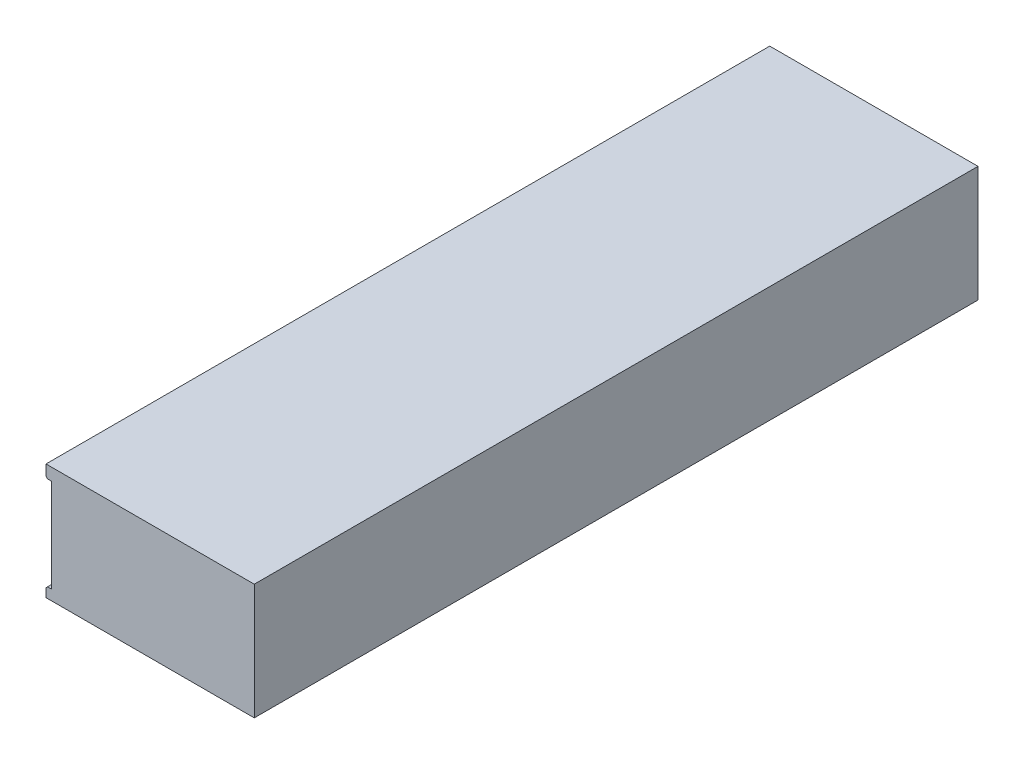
ISO-10303-21;
HEADER;
FILE_DESCRIPTION(('STEP AP214'),'2;1');
FILE_NAME('part.step','',(''),(''),'','','');
FILE_SCHEMA(('AUTOMOTIVE_DESIGN { 1 0 10303 214 1 1 1 1 }'));
ENDSEC;
DATA;
#1=APPLICATION_CONTEXT('core data for automotive mechanical design processes');
#2=APPLICATION_PROTOCOL_DEFINITION('international standard','automotive_design',2000,#1);
#3=PRODUCT_CONTEXT('',#1,'mechanical');
#4=PRODUCT('Part','Part','',(#3));
#5=PRODUCT_RELATED_PRODUCT_CATEGORY('part','',(#4));
#6=PRODUCT_DEFINITION_FORMATION('','',#4);
#7=PRODUCT_DEFINITION_CONTEXT('part definition',#1,'design');
#8=PRODUCT_DEFINITION('design','',#6,#7);
#9=PRODUCT_DEFINITION_SHAPE('','',#8);
#10=(LENGTH_UNIT() NAMED_UNIT(*) SI_UNIT(.MILLI.,.METRE.));
#11=(NAMED_UNIT(*) PLANE_ANGLE_UNIT() SI_UNIT($,.RADIAN.));
#12=(NAMED_UNIT(*) SI_UNIT($,.STERADIAN.) SOLID_ANGLE_UNIT());
#13=UNCERTAINTY_MEASURE_WITH_UNIT(LENGTH_MEASURE(1.E-05),#10,'distance_accuracy_value','');
#14=(GEOMETRIC_REPRESENTATION_CONTEXT(3) GLOBAL_UNCERTAINTY_ASSIGNED_CONTEXT((#13)) GLOBAL_UNIT_ASSIGNED_CONTEXT((#10,
#11,#12)) REPRESENTATION_CONTEXT('',''));
#15=CARTESIAN_POINT('',(0.,0.,0.));
#16=DIRECTION('',(0.,0.,1.));
#17=DIRECTION('',(1.,0.,0.));
#18=AXIS2_PLACEMENT_3D('',#15,#16,#17);
#19=CARTESIAN_POINT('',(-1.39699999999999,0.,90.4748));
#20=DIRECTION('',(0.,-1.,0.));
#21=DIRECTION('',(0.,0.,-1.));
#22=AXIS2_PLACEMENT_3D('',#19,#20,#21);
#23=PLANE('',#22);
#24=DIRECTION('',(-1.,0.,0.));
#25=VECTOR('',#24,1.);
#26=CARTESIAN_POINT('',(-1.39699999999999,0.,-90.4748));
#27=LINE('',#26,#25);
#28=CARTESIAN_POINT('',(50.673,0.,-90.4748));
#29=VERTEX_POINT('',#28);
#30=CARTESIAN_POINT('',(-1.39699999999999,0.,-90.4748));
#31=VERTEX_POINT('',#30);
#32=EDGE_CURVE('E240',#29,#31,#27,.T.);
#33=ORIENTED_EDGE('',*,*,#32,.T.);
#34=DIRECTION('',(0.,0.,-1.));
#35=VECTOR('',#34,1.);
#36=CARTESIAN_POINT('',(-1.39699999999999,0.,90.4748));
#37=LINE('',#36,#35);
#38=CARTESIAN_POINT('',(-1.39699999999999,0.,90.4748));
#39=VERTEX_POINT('',#38);
#40=EDGE_CURVE('E291',#39,#31,#37,.T.);
#41=ORIENTED_EDGE('',*,*,#40,.F.);
#42=DIRECTION('',(-1.,0.,0.));
#43=VECTOR('',#42,1.);
#44=CARTESIAN_POINT('',(-1.39699999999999,0.,90.4748));
#45=LINE('',#44,#43);
#46=CARTESIAN_POINT('',(50.673,0.,90.4748));
#47=VERTEX_POINT('',#46);
#48=EDGE_CURVE('E241',#47,#39,#45,.T.);
#49=ORIENTED_EDGE('',*,*,#48,.F.);
#50=DIRECTION('',(0.,0.,-1.));
#51=VECTOR('',#50,1.);
#52=CARTESIAN_POINT('',(50.673,0.,90.4748));
#53=LINE('',#52,#51);
#54=EDGE_CURVE('E260',#47,#29,#53,.T.);
#55=ORIENTED_EDGE('',*,*,#54,.T.);
#56=EDGE_LOOP('',(#33,#41,#49,#55));
#57=FACE_BOUND('',#56,.T.);
#58=ADVANCED_FACE('F37',(#57),#23,.F.);
#59=CARTESIAN_POINT('',(-1.39699999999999,-3.048,90.4748));
#60=DIRECTION('',(1.,0.,0.));
#61=DIRECTION('',(0.,0.,-1.));
#62=AXIS2_PLACEMENT_3D('',#59,#60,#61);
#63=PLANE('',#62);
#64=DIRECTION('',(0.,-1.,0.));
#65=VECTOR('',#64,1.);
#66=CARTESIAN_POINT('',(-1.39699999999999,-3.048,-90.4748));
#67=LINE('',#66,#65);
#68=CARTESIAN_POINT('',(-1.39699999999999,-2.66700000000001,-90.4748));
#69=VERTEX_POINT('',#68);
#70=EDGE_CURVE('E263',#31,#69,#67,.T.);
#71=ORIENTED_EDGE('',*,*,#70,.T.);
#72=DIRECTION('',(0.,0.,1.));
#73=VECTOR('',#72,1.);
#74=CARTESIAN_POINT('',(-1.39699999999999,-2.66700000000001,90.4748));
#75=LINE('',#74,#73);
#76=CARTESIAN_POINT('',(-1.39699999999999,-2.66700000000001,90.4748));
#77=VERTEX_POINT('',#76);
#78=EDGE_CURVE('E11',#69,#77,#75,.T.);
#79=ORIENTED_EDGE('',*,*,#78,.T.);
#80=DIRECTION('',(0.,-1.,0.));
#81=VECTOR('',#80,1.);
#82=CARTESIAN_POINT('',(-1.39699999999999,-3.048,90.4748));
#83=LINE('',#82,#81);
#84=EDGE_CURVE('E244',#39,#77,#83,.T.);
#85=ORIENTED_EDGE('',*,*,#84,.F.);
#86=ORIENTED_EDGE('',*,*,#40,.T.);
#87=EDGE_LOOP('',(#71,#79,#85,#86));
#88=FACE_BOUND('',#87,.T.);
#89=ADVANCED_FACE('F347',(#88),#63,.F.);
#90=CARTESIAN_POINT('',(0.,-3.048,90.4748));
#91=DIRECTION('',(0.,1.,0.));
#92=DIRECTION('',(0.,0.,1.));
#93=AXIS2_PLACEMENT_3D('',#90,#91,#92);
#94=PLANE('',#93);
#95=DIRECTION('',(1.,0.,0.));
#96=VECTOR('',#95,1.);
#97=CARTESIAN_POINT('',(0.,-3.048,90.4748));
#98=LINE('',#97,#96);
#99=CARTESIAN_POINT('',(-1.016,-3.048,90.4748));
#100=VERTEX_POINT('',#99);
#101=CARTESIAN_POINT('',(0.,-3.048,90.4748));
#102=VERTEX_POINT('',#101);
#103=EDGE_CURVE('E247',#100,#102,#98,.T.);
#104=ORIENTED_EDGE('',*,*,#103,.F.);
#105=DIRECTION('',(0.,0.,-1.));
#106=VECTOR('',#105,1.);
#107=CARTESIAN_POINT('',(-1.016,-3.048,90.4748));
#108=LINE('',#107,#106);
#109=CARTESIAN_POINT('',(-1.016,-3.048,-90.4748));
#110=VERTEX_POINT('',#109);
#111=EDGE_CURVE('E45',#100,#110,#108,.T.);
#112=ORIENTED_EDGE('',*,*,#111,.T.);
#113=DIRECTION('',(1.,0.,0.));
#114=VECTOR('',#113,1.);
#115=CARTESIAN_POINT('',(0.,-3.048,-90.4748));
#116=LINE('',#115,#114);
#117=CARTESIAN_POINT('',(0.,-3.048,-90.4748));
#118=VERTEX_POINT('',#117);
#119=EDGE_CURVE('E265',#110,#118,#116,.T.);
#120=ORIENTED_EDGE('',*,*,#119,.T.);
#121=DIRECTION('',(0.,0.,-1.));
#122=VECTOR('',#121,1.);
#123=CARTESIAN_POINT('',(0.,-3.048,90.4748));
#124=LINE('',#123,#122);
#125=EDGE_CURVE('E288',#102,#118,#124,.T.);
#126=ORIENTED_EDGE('',*,*,#125,.F.);
#127=EDGE_LOOP('',(#104,#112,#120,#126));
#128=FACE_BOUND('',#127,.T.);
#129=ADVANCED_FACE('F309',(#128),#94,.F.);
#130=CARTESIAN_POINT('',(0.,-26.416,90.4748));
#131=DIRECTION('',(1.,0.,0.));
#132=DIRECTION('',(0.,0.,-1.));
#133=AXIS2_PLACEMENT_3D('',#130,#131,#132);
#134=PLANE('',#133);
#135=CARTESIAN_POINT('',(0.,-6.34999999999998,-85.598));
#136=DIRECTION('',(-1.,0.,0.));
#137=DIRECTION('',(0.,0.,1.));
#138=AXIS2_PLACEMENT_3D('',#135,#136,#137);
#139=CIRCLE('',#138,2.413);
#140=CARTESIAN_POINT('',(0.,-6.34999999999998,-83.185));
#141=VERTEX_POINT('',#140);
#142=EDGE_CURVE('E153',#141,#141,#139,.T.);
#143=ORIENTED_EDGE('',*,*,#142,.F.);
#144=EDGE_LOOP('',(#143));
#145=FACE_BOUND('',#144,.T.);
#146=CARTESIAN_POINT('',(0.,-6.34999999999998,85.598));
#147=DIRECTION('',(-1.,0.,0.));
#148=DIRECTION('',(0.,0.,1.));
#149=AXIS2_PLACEMENT_3D('',#146,#147,#148);
#150=CIRCLE('',#149,2.413);
#151=CARTESIAN_POINT('',(0.,-6.34999999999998,88.011));
#152=VERTEX_POINT('',#151);
#153=EDGE_CURVE('E165',#152,#152,#150,.T.);
#154=ORIENTED_EDGE('',*,*,#153,.F.);
#155=EDGE_LOOP('',(#154));
#156=FACE_BOUND('',#155,.T.);
#157=CARTESIAN_POINT('',(0.,-6.34999999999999,4.8768));
#158=DIRECTION('',(-1.,0.,0.));
#159=DIRECTION('',(0.,0.,1.));
#160=AXIS2_PLACEMENT_3D('',#157,#158,#159);
#161=CIRCLE('',#160,2.413);
#162=CARTESIAN_POINT('',(0.,-6.34999999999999,7.2898));
#163=VERTEX_POINT('',#162);
#164=EDGE_CURVE('E177',#163,#163,#161,.T.);
#165=ORIENTED_EDGE('',*,*,#164,.F.);
#166=EDGE_LOOP('',(#165));
#167=FACE_BOUND('',#166,.T.);
#168=CARTESIAN_POINT('',(0.,-6.34999999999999,-4.8768));
#169=DIRECTION('',(-1.,0.,0.));
#170=DIRECTION('',(0.,0.,1.));
#171=AXIS2_PLACEMENT_3D('',#168,#169,#170);
#172=CIRCLE('',#171,2.413);
#173=CARTESIAN_POINT('',(0.,-6.34999999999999,-2.4638));
#174=VERTEX_POINT('',#173);
#175=EDGE_CURVE('E189',#174,#174,#172,.T.);
#176=ORIENTED_EDGE('',*,*,#175,.F.);
#177=EDGE_LOOP('',(#176));
#178=FACE_BOUND('',#177,.T.);
#179=CARTESIAN_POINT('',(0.,-23.114,-85.598));
#180=DIRECTION('',(-1.,0.,0.));
#181=DIRECTION('',(0.,0.,1.));
#182=AXIS2_PLACEMENT_3D('',#179,#180,#181);
#183=CIRCLE('',#182,2.413);
#184=CARTESIAN_POINT('',(0.,-23.114,-83.185));
#185=VERTEX_POINT('',#184);
#186=EDGE_CURVE('E201',#185,#185,#183,.T.);
#187=ORIENTED_EDGE('',*,*,#186,.F.);
#188=EDGE_LOOP('',(#187));
#189=FACE_BOUND('',#188,.T.);
#190=CARTESIAN_POINT('',(0.,-23.114,-4.8768));
#191=DIRECTION('',(-1.,0.,0.));
#192=DIRECTION('',(0.,0.,1.));
#193=AXIS2_PLACEMENT_3D('',#190,#191,#192);
#194=CIRCLE('',#193,2.413);
#195=CARTESIAN_POINT('',(0.,-23.114,-2.4638));
#196=VERTEX_POINT('',#195);
#197=EDGE_CURVE('E213',#196,#196,#194,.T.);
#198=ORIENTED_EDGE('',*,*,#197,.F.);
#199=EDGE_LOOP('',(#198));
#200=FACE_BOUND('',#199,.T.);
#201=CARTESIAN_POINT('',(0.,-23.114,4.8768));
#202=DIRECTION('',(-1.,0.,0.));
#203=DIRECTION('',(0.,0.,1.));
#204=AXIS2_PLACEMENT_3D('',#201,#202,#203);
#205=CIRCLE('',#204,2.413);
#206=CARTESIAN_POINT('',(0.,-23.114,7.2898));
#207=VERTEX_POINT('',#206);
#208=EDGE_CURVE('E225',#207,#207,#205,.T.);
#209=ORIENTED_EDGE('',*,*,#208,.F.);
#210=EDGE_LOOP('',(#209));
#211=FACE_BOUND('',#210,.T.);
#212=CARTESIAN_POINT('',(0.,-23.114,85.598));
#213=DIRECTION('',(-1.,0.,0.));
#214=DIRECTION('',(0.,0.,1.));
#215=AXIS2_PLACEMENT_3D('',#212,#213,#214);
#216=CIRCLE('',#215,2.413);
#217=CARTESIAN_POINT('',(0.,-23.114,88.011));
#218=VERTEX_POINT('',#217);
#219=EDGE_CURVE('E237',#218,#218,#216,.T.);
#220=ORIENTED_EDGE('',*,*,#219,.F.);
#221=EDGE_LOOP('',(#220));
#222=FACE_BOUND('',#221,.T.);
#223=DIRECTION('',(0.,-1.,0.));
#224=VECTOR('',#223,1.);
#225=CARTESIAN_POINT('',(0.,-26.416,-90.4748));
#226=LINE('',#225,#224);
#227=CARTESIAN_POINT('',(0.,-26.416,-90.4748));
#228=VERTEX_POINT('',#227);
#229=EDGE_CURVE('E267',#118,#228,#226,.T.);
#230=ORIENTED_EDGE('',*,*,#229,.T.);
#231=DIRECTION('',(0.,0.,-1.));
#232=VECTOR('',#231,1.);
#233=CARTESIAN_POINT('',(0.,-26.416,90.4748));
#234=LINE('',#233,#232);
#235=CARTESIAN_POINT('',(0.,-26.416,90.4748));
#236=VERTEX_POINT('',#235);
#237=EDGE_CURVE('E285',#236,#228,#234,.T.);
#238=ORIENTED_EDGE('',*,*,#237,.F.);
#239=DIRECTION('',(0.,-1.,0.));
#240=VECTOR('',#239,1.);
#241=CARTESIAN_POINT('',(0.,-26.416,90.4748));
#242=LINE('',#241,#240);
#243=EDGE_CURVE('E249',#102,#236,#242,.T.);
#244=ORIENTED_EDGE('',*,*,#243,.F.);
#245=ORIENTED_EDGE('',*,*,#125,.T.);
#246=EDGE_LOOP('',(#230,#238,#244,#245));
#247=FACE_BOUND('',#246,.T.);
#248=ADVANCED_FACE('F319',(#145,#156,#167,#178,#189,#200,#211,#222,#247),#134,.F.);
#249=CARTESIAN_POINT('',(-1.39699999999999,-26.416,90.4748));
#250=DIRECTION('',(0.,-1.,0.));
#251=DIRECTION('',(0.,0.,-1.));
#252=AXIS2_PLACEMENT_3D('',#249,#250,#251);
#253=PLANE('',#252);
#254=DIRECTION('',(-1.,0.,0.));
#255=VECTOR('',#254,1.);
#256=CARTESIAN_POINT('',(-1.39699999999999,-26.416,-90.4748));
#257=LINE('',#256,#255);
#258=CARTESIAN_POINT('',(-1.01599999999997,-26.416,-90.4748));
#259=VERTEX_POINT('',#258);
#260=EDGE_CURVE('E269',#228,#259,#257,.T.);
#261=ORIENTED_EDGE('',*,*,#260,.T.);
#262=DIRECTION('',(0.,0.,1.));
#263=VECTOR('',#262,1.);
#264=CARTESIAN_POINT('',(-1.01599999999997,-26.416,90.4748));
#265=LINE('',#264,#263);
#266=CARTESIAN_POINT('',(-1.01599999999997,-26.416,90.4748));
#267=VERTEX_POINT('',#266);
#268=EDGE_CURVE('E301',#259,#267,#265,.T.);
#269=ORIENTED_EDGE('',*,*,#268,.T.);
#270=DIRECTION('',(-1.,0.,0.));
#271=VECTOR('',#270,1.);
#272=CARTESIAN_POINT('',(-1.39699999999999,-26.416,90.4748));
#273=LINE('',#272,#271);
#274=EDGE_CURVE('E251',#236,#267,#273,.T.);
#275=ORIENTED_EDGE('',*,*,#274,.F.);
#276=ORIENTED_EDGE('',*,*,#237,.T.);
#277=EDGE_LOOP('',(#261,#269,#275,#276));
#278=FACE_BOUND('',#277,.T.);
#279=ADVANCED_FACE('F323',(#278),#253,.F.);
#280=CARTESIAN_POINT('',(-1.39699999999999,-28.956,90.4748));
#281=DIRECTION('',(1.,0.,0.));
#282=DIRECTION('',(0.,1.,0.));
#283=AXIS2_PLACEMENT_3D('',#280,#281,#282);
#284=PLANE('',#283);
#285=DIRECTION('',(0.,-1.,0.));
#286=VECTOR('',#285,1.);
#287=CARTESIAN_POINT('',(-1.39699999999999,-28.956,90.4748));
#288=LINE('',#287,#286);
#289=CARTESIAN_POINT('',(-1.39699999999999,-26.797,90.4748));
#290=VERTEX_POINT('',#289);
#291=CARTESIAN_POINT('',(-1.39699999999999,-28.956,90.4748));
#292=VERTEX_POINT('',#291);
#293=EDGE_CURVE('E254',#290,#292,#288,.T.);
#294=ORIENTED_EDGE('',*,*,#293,.F.);
#295=DIRECTION('',(0.,0.,-1.));
#296=VECTOR('',#295,1.);
#297=CARTESIAN_POINT('',(-1.39699999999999,-26.797,90.4748));
#298=LINE('',#297,#296);
#299=CARTESIAN_POINT('',(-1.39699999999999,-26.797,-90.4748));
#300=VERTEX_POINT('',#299);
#301=EDGE_CURVE('E294',#290,#300,#298,.T.);
#302=ORIENTED_EDGE('',*,*,#301,.T.);
#303=DIRECTION('',(0.,-1.,0.));
#304=VECTOR('',#303,1.);
#305=CARTESIAN_POINT('',(-1.39699999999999,-28.956,-90.4748));
#306=LINE('',#305,#304);
#307=CARTESIAN_POINT('',(-1.39699999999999,-28.956,-90.4748));
#308=VERTEX_POINT('',#307);
#309=EDGE_CURVE('E272',#300,#308,#306,.T.);
#310=ORIENTED_EDGE('',*,*,#309,.T.);
#311=DIRECTION('',(0.,0.,-1.));
#312=VECTOR('',#311,1.);
#313=CARTESIAN_POINT('',(-1.39699999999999,-28.956,90.4748));
#314=LINE('',#313,#312);
#315=EDGE_CURVE('E282',#292,#308,#314,.T.);
#316=ORIENTED_EDGE('',*,*,#315,.F.);
#317=EDGE_LOOP('',(#294,#302,#310,#316));
#318=FACE_BOUND('',#317,.T.);
#319=ADVANCED_FACE('F331',(#318),#284,.F.);
#320=CARTESIAN_POINT('',(50.673,-28.956,90.4748));
#321=DIRECTION('',(0.,1.,0.));
#322=DIRECTION('',(-1.,0.,0.));
#323=AXIS2_PLACEMENT_3D('',#320,#321,#322);
#324=PLANE('',#323);
#325=DIRECTION('',(1.,0.,0.));
#326=VECTOR('',#325,1.);
#327=CARTESIAN_POINT('',(50.673,-28.956,-90.4748));
#328=LINE('',#327,#326);
#329=CARTESIAN_POINT('',(50.673,-28.956,-90.4748));
#330=VERTEX_POINT('',#329);
#331=EDGE_CURVE('E274',#308,#330,#328,.T.);
#332=ORIENTED_EDGE('',*,*,#331,.T.);
#333=DIRECTION('',(0.,0.,-1.));
#334=VECTOR('',#333,1.);
#335=CARTESIAN_POINT('',(50.673,-28.956,90.4748));
#336=LINE('',#335,#334);
#337=CARTESIAN_POINT('',(50.673,-28.956,90.4748));
#338=VERTEX_POINT('',#337);
#339=EDGE_CURVE('E279',#338,#330,#336,.T.);
#340=ORIENTED_EDGE('',*,*,#339,.F.);
#341=DIRECTION('',(1.,0.,0.));
#342=VECTOR('',#341,1.);
#343=CARTESIAN_POINT('',(50.673,-28.956,90.4748));
#344=LINE('',#343,#342);
#345=EDGE_CURVE('E256',#292,#338,#344,.T.);
#346=ORIENTED_EDGE('',*,*,#345,.F.);
#347=ORIENTED_EDGE('',*,*,#315,.T.);
#348=EDGE_LOOP('',(#332,#340,#346,#347));
#349=FACE_BOUND('',#348,.T.);
#350=ADVANCED_FACE('F338',(#349),#324,.F.);
#351=CARTESIAN_POINT('',(50.673,0.,90.4748));
#352=DIRECTION('',(-1.,0.,0.));
#353=DIRECTION('',(0.,-1.,0.));
#354=AXIS2_PLACEMENT_3D('',#351,#352,#353);
#355=PLANE('',#354);
#356=DIRECTION('',(0.,1.,0.));
#357=VECTOR('',#356,1.);
#358=CARTESIAN_POINT('',(50.673,0.,-90.4748));
#359=LINE('',#358,#357);
#360=EDGE_CURVE('E245',#330,#29,#359,.T.);
#361=ORIENTED_EDGE('',*,*,#360,.T.);
#362=ORIENTED_EDGE('',*,*,#54,.F.);
#363=DIRECTION('',(0.,1.,0.));
#364=VECTOR('',#363,1.);
#365=CARTESIAN_POINT('',(50.673,0.,90.4748));
#366=LINE('',#365,#364);
#367=EDGE_CURVE('E258',#338,#47,#366,.T.);
#368=ORIENTED_EDGE('',*,*,#367,.F.);
#369=ORIENTED_EDGE('',*,*,#339,.T.);
#370=EDGE_LOOP('',(#361,#362,#368,#369));
#371=FACE_BOUND('',#370,.T.);
#372=ADVANCED_FACE('F342',(#371),#355,.F.);
#373=CARTESIAN_POINT('',(0.,0.,90.4748));
#374=DIRECTION('',(0.,0.,1.));
#375=DIRECTION('',(1.,0.,0.));
#376=AXIS2_PLACEMENT_3D('',#373,#374,#375);
#377=PLANE('',#376);
#378=ORIENTED_EDGE('',*,*,#274,.T.);
#379=DIRECTION('',(0.707106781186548,0.707106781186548,0.));
#380=VECTOR('',#379,1.);
#381=CARTESIAN_POINT('',(12.7,-12.7,90.4748));
#382=LINE('',#381,#380);
#383=EDGE_CURVE('E304',#267,#290,#382,.F.);
#384=ORIENTED_EDGE('',*,*,#383,.T.);
#385=ORIENTED_EDGE('',*,*,#293,.T.);
#386=ORIENTED_EDGE('',*,*,#345,.T.);
#387=ORIENTED_EDGE('',*,*,#367,.T.);
#388=ORIENTED_EDGE('',*,*,#48,.T.);
#389=ORIENTED_EDGE('',*,*,#84,.T.);
#390=DIRECTION('',(-0.707106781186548,0.707106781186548,0.));
#391=VECTOR('',#390,1.);
#392=CARTESIAN_POINT('',(-2.032,-2.032,90.4748));
#393=LINE('',#392,#391);
#394=EDGE_CURVE('E52',#77,#100,#393,.F.);
#395=ORIENTED_EDGE('',*,*,#394,.T.);
#396=ORIENTED_EDGE('',*,*,#103,.T.);
#397=ORIENTED_EDGE('',*,*,#243,.T.);
#398=EDGE_LOOP('',(#378,#384,#385,#386,#387,#388,#389,#395,#396,#397));
#399=FACE_BOUND('',#398,.T.);
#400=ADVANCED_FACE('F326',(#399),#377,.T.);
#401=CARTESIAN_POINT('',(0.,0.,-90.4748));
#402=DIRECTION('',(0.,0.,1.));
#403=DIRECTION('',(1.,0.,0.));
#404=AXIS2_PLACEMENT_3D('',#401,#402,#403);
#405=PLANE('',#404);
#406=ORIENTED_EDGE('',*,*,#309,.F.);
#407=DIRECTION('',(-0.707106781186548,-0.707106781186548,0.));
#408=VECTOR('',#407,1.);
#409=CARTESIAN_POINT('',(-1.39699999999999,-26.797,-90.4748));
#410=LINE('',#409,#408);
#411=EDGE_CURVE('E299',#300,#259,#410,.F.);
#412=ORIENTED_EDGE('',*,*,#411,.T.);
#413=ORIENTED_EDGE('',*,*,#260,.F.);
#414=ORIENTED_EDGE('',*,*,#229,.F.);
#415=ORIENTED_EDGE('',*,*,#119,.F.);
#416=DIRECTION('',(0.707106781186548,-0.707106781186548,0.));
#417=VECTOR('',#416,1.);
#418=CARTESIAN_POINT('',(-1.016,-3.048,-90.4748));
#419=LINE('',#418,#417);
#420=EDGE_CURVE('E297',#110,#69,#419,.F.);
#421=ORIENTED_EDGE('',*,*,#420,.T.);
#422=ORIENTED_EDGE('',*,*,#70,.F.);
#423=ORIENTED_EDGE('',*,*,#32,.F.);
#424=ORIENTED_EDGE('',*,*,#360,.F.);
#425=ORIENTED_EDGE('',*,*,#331,.F.);
#426=EDGE_LOOP('',(#406,#412,#413,#414,#415,#421,#422,#423,#424,#425));
#427=FACE_BOUND('',#426,.T.);
#428=ADVANCED_FACE('F315',(#427),#405,.F.);
#429=CARTESIAN_POINT('',(0.,-23.114,85.598));
#430=DIRECTION('',(-1.,0.,0.));
#431=DIRECTION('',(0.,0.,1.));
#432=AXIS2_PLACEMENT_3D('',#429,#430,#431);
#433=CYLINDRICAL_SURFACE('',#432,2.413);
#434=CARTESIAN_POINT('',(7.62,-23.114,85.598));
#435=DIRECTION('',(-1.,0.,0.));
#436=DIRECTION('',(0.,0.,1.));
#437=AXIS2_PLACEMENT_3D('',#434,#435,#436);
#438=CIRCLE('',#437,2.413);
#439=CARTESIAN_POINT('',(7.62,-23.114,88.011));
#440=VERTEX_POINT('',#439);
#441=EDGE_CURVE('E234',#440,#440,#438,.T.);
#442=ORIENTED_EDGE('',*,*,#441,.F.);
#443=EDGE_LOOP('',(#442));
#444=FACE_BOUND('',#443,.T.);
#445=ORIENTED_EDGE('',*,*,#219,.T.);
#446=EDGE_LOOP('',(#445));
#447=FACE_BOUND('',#446,.T.);
#448=ADVANCED_FACE('F374',(#444,#447),#433,.F.);
#449=CARTESIAN_POINT('',(7.62,-21.0947,85.598));
#450=DIRECTION('',(1.,0.,0.));
#451=DIRECTION('',(0.,0.,-1.));
#452=AXIS2_PLACEMENT_3D('',#449,#450,#451);
#453=PLANE('',#452);
#454=CARTESIAN_POINT('',(7.62,-23.114,85.598));
#455=DIRECTION('',(-1.,0.,0.));
#456=DIRECTION('',(0.,0.,1.));
#457=AXIS2_PLACEMENT_3D('',#454,#455,#456);
#458=CIRCLE('',#457,2.0193);
#459=CARTESIAN_POINT('',(7.62,-23.114,87.6173));
#460=VERTEX_POINT('',#459);
#461=EDGE_CURVE('E231',#460,#460,#458,.T.);
#462=ORIENTED_EDGE('',*,*,#461,.F.);
#463=EDGE_LOOP('',(#462));
#464=FACE_BOUND('',#463,.T.);
#465=ORIENTED_EDGE('',*,*,#441,.T.);
#466=EDGE_LOOP('',(#465));
#467=FACE_BOUND('',#466,.T.);
#468=ADVANCED_FACE('F379',(#464,#467),#453,.F.);
#469=CARTESIAN_POINT('',(0.,-23.114,85.598));
#470=DIRECTION('',(-1.,0.,0.));
#471=DIRECTION('',(0.,0.,1.));
#472=AXIS2_PLACEMENT_3D('',#469,#470,#471);
#473=CYLINDRICAL_SURFACE('',#472,2.0193);
#474=CARTESIAN_POINT('',(9.99744,-23.114,85.598));
#475=DIRECTION('',(-1.,0.,0.));
#476=DIRECTION('',(0.,0.,1.));
#477=AXIS2_PLACEMENT_3D('',#474,#475,#476);
#478=CIRCLE('',#477,2.0193);
#479=CARTESIAN_POINT('',(9.99744,-23.114,87.6173));
#480=VERTEX_POINT('',#479);
#481=EDGE_CURVE('E228',#480,#480,#478,.T.);
#482=ORIENTED_EDGE('',*,*,#481,.F.);
#483=EDGE_LOOP('',(#482));
#484=FACE_BOUND('',#483,.T.);
#485=ORIENTED_EDGE('',*,*,#461,.T.);
#486=EDGE_LOOP('',(#485));
#487=FACE_BOUND('',#486,.T.);
#488=ADVANCED_FACE('F383',(#484,#487),#473,.F.);
#489=CARTESIAN_POINT('',(9.99744,-23.114,85.598));
#490=DIRECTION('',(-1.,0.,0.));
#491=DIRECTION('',(0.,0.,1.));
#492=AXIS2_PLACEMENT_3D('',#489,#490,#491);
#493=CONICAL_SURFACE('',#492,2.0193,1.02974425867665);
#494=CARTESIAN_POINT('',(11.2107578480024,-23.114,85.598));
#495=VERTEX_POINT('',#494);
#496=VERTEX_LOOP('',#495);
#497=FACE_BOUND('',#496,.T.);
#498=ORIENTED_EDGE('',*,*,#481,.T.);
#499=EDGE_LOOP('',(#498));
#500=FACE_BOUND('',#499,.T.);
#501=ADVANCED_FACE('F387',(#497,#500),#493,.F.);
#502=CARTESIAN_POINT('',(0.,-23.114,4.8768));
#503=DIRECTION('',(-1.,0.,0.));
#504=DIRECTION('',(0.,0.,1.));
#505=AXIS2_PLACEMENT_3D('',#502,#503,#504);
#506=CYLINDRICAL_SURFACE('',#505,2.413);
#507=CARTESIAN_POINT('',(7.62,-23.114,4.8768));
#508=DIRECTION('',(-1.,0.,0.));
#509=DIRECTION('',(0.,0.,1.));
#510=AXIS2_PLACEMENT_3D('',#507,#508,#509);
#511=CIRCLE('',#510,2.413);
#512=CARTESIAN_POINT('',(7.62,-23.114,7.2898));
#513=VERTEX_POINT('',#512);
#514=EDGE_CURVE('E222',#513,#513,#511,.T.);
#515=ORIENTED_EDGE('',*,*,#514,.F.);
#516=EDGE_LOOP('',(#515));
#517=FACE_BOUND('',#516,.T.);
#518=ORIENTED_EDGE('',*,*,#208,.T.);
#519=EDGE_LOOP('',(#518));
#520=FACE_BOUND('',#519,.T.);
#521=ADVANCED_FACE('F391',(#517,#520),#506,.F.);
#522=CARTESIAN_POINT('',(7.62,-21.0947,4.8768));
#523=DIRECTION('',(1.,0.,0.));
#524=DIRECTION('',(0.,0.,-1.));
#525=AXIS2_PLACEMENT_3D('',#522,#523,#524);
#526=PLANE('',#525);
#527=CARTESIAN_POINT('',(7.62,-23.114,4.8768));
#528=DIRECTION('',(-1.,0.,0.));
#529=DIRECTION('',(0.,0.,1.));
#530=AXIS2_PLACEMENT_3D('',#527,#528,#529);
#531=CIRCLE('',#530,2.0193);
#532=CARTESIAN_POINT('',(7.62,-23.114,6.8961));
#533=VERTEX_POINT('',#532);
#534=EDGE_CURVE('E219',#533,#533,#531,.T.);
#535=ORIENTED_EDGE('',*,*,#534,.F.);
#536=EDGE_LOOP('',(#535));
#537=FACE_BOUND('',#536,.T.);
#538=ORIENTED_EDGE('',*,*,#514,.T.);
#539=EDGE_LOOP('',(#538));
#540=FACE_BOUND('',#539,.T.);
#541=ADVANCED_FACE('F395',(#537,#540),#526,.F.);
#542=CARTESIAN_POINT('',(0.,-23.114,4.8768));
#543=DIRECTION('',(-1.,0.,0.));
#544=DIRECTION('',(0.,0.,1.));
#545=AXIS2_PLACEMENT_3D('',#542,#543,#544);
#546=CYLINDRICAL_SURFACE('',#545,2.0193);
#547=CARTESIAN_POINT('',(9.99744,-23.114,4.8768));
#548=DIRECTION('',(-1.,0.,0.));
#549=DIRECTION('',(0.,0.,1.));
#550=AXIS2_PLACEMENT_3D('',#547,#548,#549);
#551=CIRCLE('',#550,2.0193);
#552=CARTESIAN_POINT('',(9.99744,-23.114,6.8961));
#553=VERTEX_POINT('',#552);
#554=EDGE_CURVE('E216',#553,#553,#551,.T.);
#555=ORIENTED_EDGE('',*,*,#554,.F.);
#556=EDGE_LOOP('',(#555));
#557=FACE_BOUND('',#556,.T.);
#558=ORIENTED_EDGE('',*,*,#534,.T.);
#559=EDGE_LOOP('',(#558));
#560=FACE_BOUND('',#559,.T.);
#561=ADVANCED_FACE('F399',(#557,#560),#546,.F.);
#562=CARTESIAN_POINT('',(9.99744,-23.114,4.8768));
#563=DIRECTION('',(-1.,0.,0.));
#564=DIRECTION('',(0.,0.,1.));
#565=AXIS2_PLACEMENT_3D('',#562,#563,#564);
#566=CONICAL_SURFACE('',#565,2.0193,1.02974425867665);
#567=CARTESIAN_POINT('',(11.2107578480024,-23.114,4.8768));
#568=VERTEX_POINT('',#567);
#569=VERTEX_LOOP('',#568);
#570=FACE_BOUND('',#569,.T.);
#571=ORIENTED_EDGE('',*,*,#554,.T.);
#572=EDGE_LOOP('',(#571));
#573=FACE_BOUND('',#572,.T.);
#574=ADVANCED_FACE('F403',(#570,#573),#566,.F.);
#575=CARTESIAN_POINT('',(0.,-23.114,-4.8768));
#576=DIRECTION('',(-1.,0.,0.));
#577=DIRECTION('',(0.,0.,1.));
#578=AXIS2_PLACEMENT_3D('',#575,#576,#577);
#579=CYLINDRICAL_SURFACE('',#578,2.413);
#580=CARTESIAN_POINT('',(7.62,-23.114,-4.8768));
#581=DIRECTION('',(-1.,0.,0.));
#582=DIRECTION('',(0.,0.,1.));
#583=AXIS2_PLACEMENT_3D('',#580,#581,#582);
#584=CIRCLE('',#583,2.413);
#585=CARTESIAN_POINT('',(7.62,-23.114,-2.4638));
#586=VERTEX_POINT('',#585);
#587=EDGE_CURVE('E210',#586,#586,#584,.T.);
#588=ORIENTED_EDGE('',*,*,#587,.F.);
#589=EDGE_LOOP('',(#588));
#590=FACE_BOUND('',#589,.T.);
#591=ORIENTED_EDGE('',*,*,#197,.T.);
#592=EDGE_LOOP('',(#591));
#593=FACE_BOUND('',#592,.T.);
#594=ADVANCED_FACE('F407',(#590,#593),#579,.F.);
#595=CARTESIAN_POINT('',(7.62,-21.0947,-4.8768));
#596=DIRECTION('',(1.,0.,0.));
#597=DIRECTION('',(0.,0.,-1.));
#598=AXIS2_PLACEMENT_3D('',#595,#596,#597);
#599=PLANE('',#598);
#600=CARTESIAN_POINT('',(7.62,-23.114,-4.8768));
#601=DIRECTION('',(-1.,0.,0.));
#602=DIRECTION('',(0.,0.,1.));
#603=AXIS2_PLACEMENT_3D('',#600,#601,#602);
#604=CIRCLE('',#603,2.0193);
#605=CARTESIAN_POINT('',(7.62,-23.114,-2.8575));
#606=VERTEX_POINT('',#605);
#607=EDGE_CURVE('E207',#606,#606,#604,.T.);
#608=ORIENTED_EDGE('',*,*,#607,.F.);
#609=EDGE_LOOP('',(#608));
#610=FACE_BOUND('',#609,.T.);
#611=ORIENTED_EDGE('',*,*,#587,.T.);
#612=EDGE_LOOP('',(#611));
#613=FACE_BOUND('',#612,.T.);
#614=ADVANCED_FACE('F411',(#610,#613),#599,.F.);
#615=CARTESIAN_POINT('',(0.,-23.114,-4.8768));
#616=DIRECTION('',(-1.,0.,0.));
#617=DIRECTION('',(0.,0.,1.));
#618=AXIS2_PLACEMENT_3D('',#615,#616,#617);
#619=CYLINDRICAL_SURFACE('',#618,2.0193);
#620=CARTESIAN_POINT('',(9.99744,-23.114,-4.8768));
#621=DIRECTION('',(-1.,0.,0.));
#622=DIRECTION('',(0.,0.,1.));
#623=AXIS2_PLACEMENT_3D('',#620,#621,#622);
#624=CIRCLE('',#623,2.0193);
#625=CARTESIAN_POINT('',(9.99744,-23.114,-2.8575));
#626=VERTEX_POINT('',#625);
#627=EDGE_CURVE('E204',#626,#626,#624,.T.);
#628=ORIENTED_EDGE('',*,*,#627,.F.);
#629=EDGE_LOOP('',(#628));
#630=FACE_BOUND('',#629,.T.);
#631=ORIENTED_EDGE('',*,*,#607,.T.);
#632=EDGE_LOOP('',(#631));
#633=FACE_BOUND('',#632,.T.);
#634=ADVANCED_FACE('F415',(#630,#633),#619,.F.);
#635=CARTESIAN_POINT('',(9.99744,-23.114,-4.8768));
#636=DIRECTION('',(-1.,0.,0.));
#637=DIRECTION('',(0.,0.,1.));
#638=AXIS2_PLACEMENT_3D('',#635,#636,#637);
#639=CONICAL_SURFACE('',#638,2.0193,1.02974425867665);
#640=CARTESIAN_POINT('',(11.2107578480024,-23.114,-4.8768));
#641=VERTEX_POINT('',#640);
#642=VERTEX_LOOP('',#641);
#643=FACE_BOUND('',#642,.T.);
#644=ORIENTED_EDGE('',*,*,#627,.T.);
#645=EDGE_LOOP('',(#644));
#646=FACE_BOUND('',#645,.T.);
#647=ADVANCED_FACE('F419',(#643,#646),#639,.F.);
#648=CARTESIAN_POINT('',(0.,-23.114,-85.598));
#649=DIRECTION('',(-1.,0.,0.));
#650=DIRECTION('',(0.,0.,1.));
#651=AXIS2_PLACEMENT_3D('',#648,#649,#650);
#652=CYLINDRICAL_SURFACE('',#651,2.413);
#653=CARTESIAN_POINT('',(7.61999999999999,-23.114,-85.598));
#654=DIRECTION('',(-1.,0.,0.));
#655=DIRECTION('',(0.,0.,1.));
#656=AXIS2_PLACEMENT_3D('',#653,#654,#655);
#657=CIRCLE('',#656,2.413);
#658=CARTESIAN_POINT('',(7.61999999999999,-23.114,-83.185));
#659=VERTEX_POINT('',#658);
#660=EDGE_CURVE('E198',#659,#659,#657,.T.);
#661=ORIENTED_EDGE('',*,*,#660,.F.);
#662=EDGE_LOOP('',(#661));
#663=FACE_BOUND('',#662,.T.);
#664=ORIENTED_EDGE('',*,*,#186,.T.);
#665=EDGE_LOOP('',(#664));
#666=FACE_BOUND('',#665,.T.);
#667=ADVANCED_FACE('F423',(#663,#666),#652,.F.);
#668=CARTESIAN_POINT('',(7.61999999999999,-21.0947,-85.598));
#669=DIRECTION('',(1.,0.,0.));
#670=DIRECTION('',(0.,0.,-1.));
#671=AXIS2_PLACEMENT_3D('',#668,#669,#670);
#672=PLANE('',#671);
#673=CARTESIAN_POINT('',(7.61999999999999,-23.114,-85.598));
#674=DIRECTION('',(-1.,0.,0.));
#675=DIRECTION('',(0.,0.,1.));
#676=AXIS2_PLACEMENT_3D('',#673,#674,#675);
#677=CIRCLE('',#676,2.0193);
#678=CARTESIAN_POINT('',(7.61999999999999,-23.114,-83.5787));
#679=VERTEX_POINT('',#678);
#680=EDGE_CURVE('E195',#679,#679,#677,.T.);
#681=ORIENTED_EDGE('',*,*,#680,.F.);
#682=EDGE_LOOP('',(#681));
#683=FACE_BOUND('',#682,.T.);
#684=ORIENTED_EDGE('',*,*,#660,.T.);
#685=EDGE_LOOP('',(#684));
#686=FACE_BOUND('',#685,.T.);
#687=ADVANCED_FACE('F427',(#683,#686),#672,.F.);
#688=CARTESIAN_POINT('',(0.,-23.114,-85.598));
#689=DIRECTION('',(-1.,0.,0.));
#690=DIRECTION('',(0.,0.,1.));
#691=AXIS2_PLACEMENT_3D('',#688,#689,#690);
#692=CYLINDRICAL_SURFACE('',#691,2.0193);
#693=CARTESIAN_POINT('',(9.99743999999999,-23.114,-85.598));
#694=DIRECTION('',(-1.,0.,0.));
#695=DIRECTION('',(0.,0.,1.));
#696=AXIS2_PLACEMENT_3D('',#693,#694,#695);
#697=CIRCLE('',#696,2.0193);
#698=CARTESIAN_POINT('',(9.99743999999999,-23.114,-83.5787));
#699=VERTEX_POINT('',#698);
#700=EDGE_CURVE('E192',#699,#699,#697,.T.);
#701=ORIENTED_EDGE('',*,*,#700,.F.);
#702=EDGE_LOOP('',(#701));
#703=FACE_BOUND('',#702,.T.);
#704=ORIENTED_EDGE('',*,*,#680,.T.);
#705=EDGE_LOOP('',(#704));
#706=FACE_BOUND('',#705,.T.);
#707=ADVANCED_FACE('F431',(#703,#706),#692,.F.);
#708=CARTESIAN_POINT('',(9.99743999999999,-23.114,-85.598));
#709=DIRECTION('',(-1.,0.,0.));
#710=DIRECTION('',(0.,0.,1.));
#711=AXIS2_PLACEMENT_3D('',#708,#709,#710);
#712=CONICAL_SURFACE('',#711,2.0193,1.02974425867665);
#713=CARTESIAN_POINT('',(11.2107578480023,-23.114,-85.598));
#714=VERTEX_POINT('',#713);
#715=VERTEX_LOOP('',#714);
#716=FACE_BOUND('',#715,.T.);
#717=ORIENTED_EDGE('',*,*,#700,.T.);
#718=EDGE_LOOP('',(#717));
#719=FACE_BOUND('',#718,.T.);
#720=ADVANCED_FACE('F435',(#716,#719),#712,.F.);
#721=CARTESIAN_POINT('',(0.,-6.34999999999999,-4.8768));
#722=DIRECTION('',(-1.,0.,0.));
#723=DIRECTION('',(0.,0.,1.));
#724=AXIS2_PLACEMENT_3D('',#721,#722,#723);
#725=CYLINDRICAL_SURFACE('',#724,2.413);
#726=CARTESIAN_POINT('',(7.62,-6.34999999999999,-4.8768));
#727=DIRECTION('',(-1.,0.,0.));
#728=DIRECTION('',(0.,0.,1.));
#729=AXIS2_PLACEMENT_3D('',#726,#727,#728);
#730=CIRCLE('',#729,2.413);
#731=CARTESIAN_POINT('',(7.62,-6.34999999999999,-2.4638));
#732=VERTEX_POINT('',#731);
#733=EDGE_CURVE('E186',#732,#732,#730,.T.);
#734=ORIENTED_EDGE('',*,*,#733,.F.);
#735=EDGE_LOOP('',(#734));
#736=FACE_BOUND('',#735,.T.);
#737=ORIENTED_EDGE('',*,*,#175,.T.);
#738=EDGE_LOOP('',(#737));
#739=FACE_BOUND('',#738,.T.);
#740=ADVANCED_FACE('F439',(#736,#739),#725,.F.);
#741=CARTESIAN_POINT('',(7.62,-4.33069999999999,-4.8768));
#742=DIRECTION('',(1.,0.,0.));
#743=DIRECTION('',(0.,0.,-1.));
#744=AXIS2_PLACEMENT_3D('',#741,#742,#743);
#745=PLANE('',#744);
#746=CARTESIAN_POINT('',(7.62,-6.34999999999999,-4.8768));
#747=DIRECTION('',(-1.,0.,0.));
#748=DIRECTION('',(0.,0.,1.));
#749=AXIS2_PLACEMENT_3D('',#746,#747,#748);
#750=CIRCLE('',#749,2.0193);
#751=CARTESIAN_POINT('',(7.62,-6.34999999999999,-2.8575));
#752=VERTEX_POINT('',#751);
#753=EDGE_CURVE('E183',#752,#752,#750,.T.);
#754=ORIENTED_EDGE('',*,*,#753,.F.);
#755=EDGE_LOOP('',(#754));
#756=FACE_BOUND('',#755,.T.);
#757=ORIENTED_EDGE('',*,*,#733,.T.);
#758=EDGE_LOOP('',(#757));
#759=FACE_BOUND('',#758,.T.);
#760=ADVANCED_FACE('F443',(#756,#759),#745,.F.);
#761=CARTESIAN_POINT('',(0.,-6.34999999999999,-4.8768));
#762=DIRECTION('',(-1.,0.,0.));
#763=DIRECTION('',(0.,0.,1.));
#764=AXIS2_PLACEMENT_3D('',#761,#762,#763);
#765=CYLINDRICAL_SURFACE('',#764,2.0193);
#766=CARTESIAN_POINT('',(9.99744,-6.34999999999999,-4.8768));
#767=DIRECTION('',(-1.,0.,0.));
#768=DIRECTION('',(0.,0.,1.));
#769=AXIS2_PLACEMENT_3D('',#766,#767,#768);
#770=CIRCLE('',#769,2.0193);
#771=CARTESIAN_POINT('',(9.99744,-6.34999999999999,-2.8575));
#772=VERTEX_POINT('',#771);
#773=EDGE_CURVE('E180',#772,#772,#770,.T.);
#774=ORIENTED_EDGE('',*,*,#773,.F.);
#775=EDGE_LOOP('',(#774));
#776=FACE_BOUND('',#775,.T.);
#777=ORIENTED_EDGE('',*,*,#753,.T.);
#778=EDGE_LOOP('',(#777));
#779=FACE_BOUND('',#778,.T.);
#780=ADVANCED_FACE('F447',(#776,#779),#765,.F.);
#781=CARTESIAN_POINT('',(9.99744,-6.34999999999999,-4.8768));
#782=DIRECTION('',(-1.,0.,0.));
#783=DIRECTION('',(0.,0.,1.));
#784=AXIS2_PLACEMENT_3D('',#781,#782,#783);
#785=CONICAL_SURFACE('',#784,2.0193,1.02974425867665);
#786=CARTESIAN_POINT('',(11.2107578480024,-6.34999999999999,-4.8768));
#787=VERTEX_POINT('',#786);
#788=VERTEX_LOOP('',#787);
#789=FACE_BOUND('',#788,.T.);
#790=ORIENTED_EDGE('',*,*,#773,.T.);
#791=EDGE_LOOP('',(#790));
#792=FACE_BOUND('',#791,.T.);
#793=ADVANCED_FACE('F451',(#789,#792),#785,.F.);
#794=CARTESIAN_POINT('',(0.,-6.34999999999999,4.8768));
#795=DIRECTION('',(-1.,0.,0.));
#796=DIRECTION('',(0.,0.,1.));
#797=AXIS2_PLACEMENT_3D('',#794,#795,#796);
#798=CYLINDRICAL_SURFACE('',#797,2.413);
#799=CARTESIAN_POINT('',(7.62,-6.34999999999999,4.8768));
#800=DIRECTION('',(-1.,0.,0.));
#801=DIRECTION('',(0.,0.,1.));
#802=AXIS2_PLACEMENT_3D('',#799,#800,#801);
#803=CIRCLE('',#802,2.413);
#804=CARTESIAN_POINT('',(7.62,-6.34999999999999,7.2898));
#805=VERTEX_POINT('',#804);
#806=EDGE_CURVE('E174',#805,#805,#803,.T.);
#807=ORIENTED_EDGE('',*,*,#806,.F.);
#808=EDGE_LOOP('',(#807));
#809=FACE_BOUND('',#808,.T.);
#810=ORIENTED_EDGE('',*,*,#164,.T.);
#811=EDGE_LOOP('',(#810));
#812=FACE_BOUND('',#811,.T.);
#813=ADVANCED_FACE('F455',(#809,#812),#798,.F.);
#814=CARTESIAN_POINT('',(7.62,-4.33069999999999,4.8768));
#815=DIRECTION('',(1.,0.,0.));
#816=DIRECTION('',(0.,0.,-1.));
#817=AXIS2_PLACEMENT_3D('',#814,#815,#816);
#818=PLANE('',#817);
#819=CARTESIAN_POINT('',(7.62,-6.34999999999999,4.8768));
#820=DIRECTION('',(-1.,0.,0.));
#821=DIRECTION('',(0.,0.,1.));
#822=AXIS2_PLACEMENT_3D('',#819,#820,#821);
#823=CIRCLE('',#822,2.0193);
#824=CARTESIAN_POINT('',(7.62,-6.34999999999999,6.8961));
#825=VERTEX_POINT('',#824);
#826=EDGE_CURVE('E171',#825,#825,#823,.T.);
#827=ORIENTED_EDGE('',*,*,#826,.F.);
#828=EDGE_LOOP('',(#827));
#829=FACE_BOUND('',#828,.T.);
#830=ORIENTED_EDGE('',*,*,#806,.T.);
#831=EDGE_LOOP('',(#830));
#832=FACE_BOUND('',#831,.T.);
#833=ADVANCED_FACE('F459',(#829,#832),#818,.F.);
#834=CARTESIAN_POINT('',(0.,-6.34999999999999,4.8768));
#835=DIRECTION('',(-1.,0.,0.));
#836=DIRECTION('',(0.,0.,1.));
#837=AXIS2_PLACEMENT_3D('',#834,#835,#836);
#838=CYLINDRICAL_SURFACE('',#837,2.0193);
#839=CARTESIAN_POINT('',(9.99744,-6.34999999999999,4.8768));
#840=DIRECTION('',(-1.,0.,0.));
#841=DIRECTION('',(0.,0.,1.));
#842=AXIS2_PLACEMENT_3D('',#839,#840,#841);
#843=CIRCLE('',#842,2.0193);
#844=CARTESIAN_POINT('',(9.99744,-6.34999999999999,6.8961));
#845=VERTEX_POINT('',#844);
#846=EDGE_CURVE('E168',#845,#845,#843,.T.);
#847=ORIENTED_EDGE('',*,*,#846,.F.);
#848=EDGE_LOOP('',(#847));
#849=FACE_BOUND('',#848,.T.);
#850=ORIENTED_EDGE('',*,*,#826,.T.);
#851=EDGE_LOOP('',(#850));
#852=FACE_BOUND('',#851,.T.);
#853=ADVANCED_FACE('F463',(#849,#852),#838,.F.);
#854=CARTESIAN_POINT('',(9.99744,-6.34999999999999,4.8768));
#855=DIRECTION('',(-1.,0.,0.));
#856=DIRECTION('',(0.,0.,1.));
#857=AXIS2_PLACEMENT_3D('',#854,#855,#856);
#858=CONICAL_SURFACE('',#857,2.0193,1.02974425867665);
#859=CARTESIAN_POINT('',(11.2107578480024,-6.34999999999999,4.8768));
#860=VERTEX_POINT('',#859);
#861=VERTEX_LOOP('',#860);
#862=FACE_BOUND('',#861,.T.);
#863=ORIENTED_EDGE('',*,*,#846,.T.);
#864=EDGE_LOOP('',(#863));
#865=FACE_BOUND('',#864,.T.);
#866=ADVANCED_FACE('F467',(#862,#865),#858,.F.);
#867=CARTESIAN_POINT('',(0.,-6.34999999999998,85.598));
#868=DIRECTION('',(-1.,0.,0.));
#869=DIRECTION('',(0.,0.,1.));
#870=AXIS2_PLACEMENT_3D('',#867,#868,#869);
#871=CYLINDRICAL_SURFACE('',#870,2.413);
#872=CARTESIAN_POINT('',(7.62,-6.34999999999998,85.598));
#873=DIRECTION('',(-1.,0.,0.));
#874=DIRECTION('',(0.,0.,1.));
#875=AXIS2_PLACEMENT_3D('',#872,#873,#874);
#876=CIRCLE('',#875,2.413);
#877=CARTESIAN_POINT('',(7.62,-6.34999999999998,88.011));
#878=VERTEX_POINT('',#877);
#879=EDGE_CURVE('E162',#878,#878,#876,.T.);
#880=ORIENTED_EDGE('',*,*,#879,.F.);
#881=EDGE_LOOP('',(#880));
#882=FACE_BOUND('',#881,.T.);
#883=ORIENTED_EDGE('',*,*,#153,.T.);
#884=EDGE_LOOP('',(#883));
#885=FACE_BOUND('',#884,.T.);
#886=ADVANCED_FACE('F471',(#882,#885),#871,.F.);
#887=CARTESIAN_POINT('',(7.62,-4.33069999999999,85.598));
#888=DIRECTION('',(1.,0.,0.));
#889=DIRECTION('',(0.,0.,-1.));
#890=AXIS2_PLACEMENT_3D('',#887,#888,#889);
#891=PLANE('',#890);
#892=CARTESIAN_POINT('',(7.62,-6.34999999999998,85.598));
#893=DIRECTION('',(-1.,0.,0.));
#894=DIRECTION('',(0.,0.,1.));
#895=AXIS2_PLACEMENT_3D('',#892,#893,#894);
#896=CIRCLE('',#895,2.0193);
#897=CARTESIAN_POINT('',(7.62,-6.34999999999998,87.6173));
#898=VERTEX_POINT('',#897);
#899=EDGE_CURVE('E159',#898,#898,#896,.T.);
#900=ORIENTED_EDGE('',*,*,#899,.F.);
#901=EDGE_LOOP('',(#900));
#902=FACE_BOUND('',#901,.T.);
#903=ORIENTED_EDGE('',*,*,#879,.T.);
#904=EDGE_LOOP('',(#903));
#905=FACE_BOUND('',#904,.T.);
#906=ADVANCED_FACE('F475',(#902,#905),#891,.F.);
#907=CARTESIAN_POINT('',(0.,-6.34999999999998,85.598));
#908=DIRECTION('',(-1.,0.,0.));
#909=DIRECTION('',(0.,0.,1.));
#910=AXIS2_PLACEMENT_3D('',#907,#908,#909);
#911=CYLINDRICAL_SURFACE('',#910,2.0193);
#912=CARTESIAN_POINT('',(9.99744,-6.34999999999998,85.598));
#913=DIRECTION('',(-1.,0.,0.));
#914=DIRECTION('',(0.,0.,1.));
#915=AXIS2_PLACEMENT_3D('',#912,#913,#914);
#916=CIRCLE('',#915,2.0193);
#917=CARTESIAN_POINT('',(9.99744,-6.34999999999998,87.6173));
#918=VERTEX_POINT('',#917);
#919=EDGE_CURVE('E156',#918,#918,#916,.T.);
#920=ORIENTED_EDGE('',*,*,#919,.F.);
#921=EDGE_LOOP('',(#920));
#922=FACE_BOUND('',#921,.T.);
#923=ORIENTED_EDGE('',*,*,#899,.T.);
#924=EDGE_LOOP('',(#923));
#925=FACE_BOUND('',#924,.T.);
#926=ADVANCED_FACE('F479',(#922,#925),#911,.F.);
#927=CARTESIAN_POINT('',(9.99744,-6.34999999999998,85.598));
#928=DIRECTION('',(-1.,0.,0.));
#929=DIRECTION('',(0.,0.,1.));
#930=AXIS2_PLACEMENT_3D('',#927,#928,#929);
#931=CONICAL_SURFACE('',#930,2.0193,1.02974425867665);
#932=CARTESIAN_POINT('',(11.2107578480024,-6.34999999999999,85.598));
#933=VERTEX_POINT('',#932);
#934=VERTEX_LOOP('',#933);
#935=FACE_BOUND('',#934,.T.);
#936=ORIENTED_EDGE('',*,*,#919,.T.);
#937=EDGE_LOOP('',(#936));
#938=FACE_BOUND('',#937,.T.);
#939=ADVANCED_FACE('F483',(#935,#938),#931,.F.);
#940=CARTESIAN_POINT('',(0.,-6.34999999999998,-85.598));
#941=DIRECTION('',(-1.,0.,0.));
#942=DIRECTION('',(0.,0.,1.));
#943=AXIS2_PLACEMENT_3D('',#940,#941,#942);
#944=CYLINDRICAL_SURFACE('',#943,2.413);
#945=CARTESIAN_POINT('',(7.61999999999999,-6.34999999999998,-85.598));
#946=DIRECTION('',(-1.,0.,0.));
#947=DIRECTION('',(0.,0.,1.));
#948=AXIS2_PLACEMENT_3D('',#945,#946,#947);
#949=CIRCLE('',#948,2.413);
#950=CARTESIAN_POINT('',(7.61999999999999,-6.34999999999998,-83.185));
#951=VERTEX_POINT('',#950);
#952=EDGE_CURVE('E148',#951,#951,#949,.T.);
#953=ORIENTED_EDGE('',*,*,#952,.F.);
#954=EDGE_LOOP('',(#953));
#955=FACE_BOUND('',#954,.T.);
#956=ORIENTED_EDGE('',*,*,#142,.T.);
#957=EDGE_LOOP('',(#956));
#958=FACE_BOUND('',#957,.T.);
#959=ADVANCED_FACE('F487',(#955,#958),#944,.F.);
#960=CARTESIAN_POINT('',(7.61999999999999,-4.33069999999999,-85.598));
#961=DIRECTION('',(1.,0.,0.));
#962=DIRECTION('',(0.,0.,-1.));
#963=AXIS2_PLACEMENT_3D('',#960,#961,#962);
#964=PLANE('',#963);
#965=CARTESIAN_POINT('',(7.61999999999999,-6.34999999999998,-85.598));
#966=DIRECTION('',(-1.,0.,0.));
#967=DIRECTION('',(0.,0.,1.));
#968=AXIS2_PLACEMENT_3D('',#965,#966,#967);
#969=CIRCLE('',#968,2.0193);
#970=CARTESIAN_POINT('',(7.61999999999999,-6.34999999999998,-83.5787));
#971=VERTEX_POINT('',#970);
#972=EDGE_CURVE('E145',#971,#971,#969,.T.);
#973=ORIENTED_EDGE('',*,*,#972,.F.);
#974=EDGE_LOOP('',(#973));
#975=FACE_BOUND('',#974,.T.);
#976=ORIENTED_EDGE('',*,*,#952,.T.);
#977=EDGE_LOOP('',(#976));
#978=FACE_BOUND('',#977,.T.);
#979=ADVANCED_FACE('F491',(#975,#978),#964,.F.);
#980=CARTESIAN_POINT('',(0.,-6.34999999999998,-85.598));
#981=DIRECTION('',(-1.,0.,0.));
#982=DIRECTION('',(0.,0.,1.));
#983=AXIS2_PLACEMENT_3D('',#980,#981,#982);
#984=CYLINDRICAL_SURFACE('',#983,2.0193);
#985=CARTESIAN_POINT('',(9.99743999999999,-6.34999999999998,-85.598));
#986=DIRECTION('',(-1.,0.,0.));
#987=DIRECTION('',(0.,0.,1.));
#988=AXIS2_PLACEMENT_3D('',#985,#986,#987);
#989=CIRCLE('',#988,2.0193);
#990=CARTESIAN_POINT('',(9.99743999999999,-6.34999999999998,-83.5787));
#991=VERTEX_POINT('',#990);
#992=EDGE_CURVE('E143',#991,#991,#989,.T.);
#993=ORIENTED_EDGE('',*,*,#992,.F.);
#994=EDGE_LOOP('',(#993));
#995=FACE_BOUND('',#994,.T.);
#996=ORIENTED_EDGE('',*,*,#972,.T.);
#997=EDGE_LOOP('',(#996));
#998=FACE_BOUND('',#997,.T.);
#999=ADVANCED_FACE('F139',(#995,#998),#984,.F.);
#1000=CARTESIAN_POINT('',(9.99743999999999,-6.34999999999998,-85.598));
#1001=DIRECTION('',(-1.,0.,0.));
#1002=DIRECTION('',(0.,0.,1.));
#1003=AXIS2_PLACEMENT_3D('',#1000,#1001,#1002);
#1004=CONICAL_SURFACE('',#1003,2.0193,1.02974425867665);
#1005=CARTESIAN_POINT('',(11.2107578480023,-6.34999999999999,-85.598));
#1006=VERTEX_POINT('',#1005);
#1007=VERTEX_LOOP('',#1006);
#1008=FACE_BOUND('',#1007,.T.);
#1009=ORIENTED_EDGE('',*,*,#992,.T.);
#1010=EDGE_LOOP('',(#1009));
#1011=FACE_BOUND('',#1010,.T.);
#1012=ADVANCED_FACE('F135',(#1008,#1011),#1004,.F.);
#1013=CARTESIAN_POINT('',(-1.39699999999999,-26.797,90.4748));
#1014=DIRECTION('',(0.707106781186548,-0.707106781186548,0.));
#1015=DIRECTION('',(0.707106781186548,0.707106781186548,0.));
#1016=AXIS2_PLACEMENT_3D('',#1013,#1014,#1015);
#1017=PLANE('',#1016);
#1018=ORIENTED_EDGE('',*,*,#383,.F.);
#1019=ORIENTED_EDGE('',*,*,#268,.F.);
#1020=ORIENTED_EDGE('',*,*,#411,.F.);
#1021=ORIENTED_EDGE('',*,*,#301,.F.);
#1022=EDGE_LOOP('',(#1018,#1019,#1020,#1021));
#1023=FACE_BOUND('',#1022,.T.);
#1024=ADVANCED_FACE('F138',(#1023),#1017,.F.);
#1025=CARTESIAN_POINT('',(-1.016,-3.048,90.4748));
#1026=DIRECTION('',(0.707106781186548,0.707106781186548,0.));
#1027=DIRECTION('',(-0.707106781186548,0.707106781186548,0.));
#1028=AXIS2_PLACEMENT_3D('',#1025,#1026,#1027);
#1029=PLANE('',#1028);
#1030=ORIENTED_EDGE('',*,*,#394,.F.);
#1031=ORIENTED_EDGE('',*,*,#78,.F.);
#1032=ORIENTED_EDGE('',*,*,#420,.F.);
#1033=ORIENTED_EDGE('',*,*,#111,.F.);
#1034=EDGE_LOOP('',(#1030,#1031,#1032,#1033));
#1035=FACE_BOUND('',#1034,.T.);
#1036=ADVANCED_FACE('F39',(#1035),#1029,.F.);
#1037=CLOSED_SHELL('',(#58,#89,#129,#248,#279,#319,#350,#372,#400,#428,#448,#468,#488,#501,#521,
#541,#561,#574,#594,#614,#634,#647,#667,#687,#707,#720,#740,#760,#780,#793,#813,#833,#853,#866,
#886,#906,#926,#939,#959,#979,#999,#1012,#1024,#1036));
#1038=MANIFOLD_SOLID_BREP('B2',#1037);
#1039=ADVANCED_BREP_SHAPE_REPRESENTATION('',(#18,#1038),#14);
#1040=SHAPE_DEFINITION_REPRESENTATION(#9,#1039);
ENDSEC;
END-ISO-10303-21;
